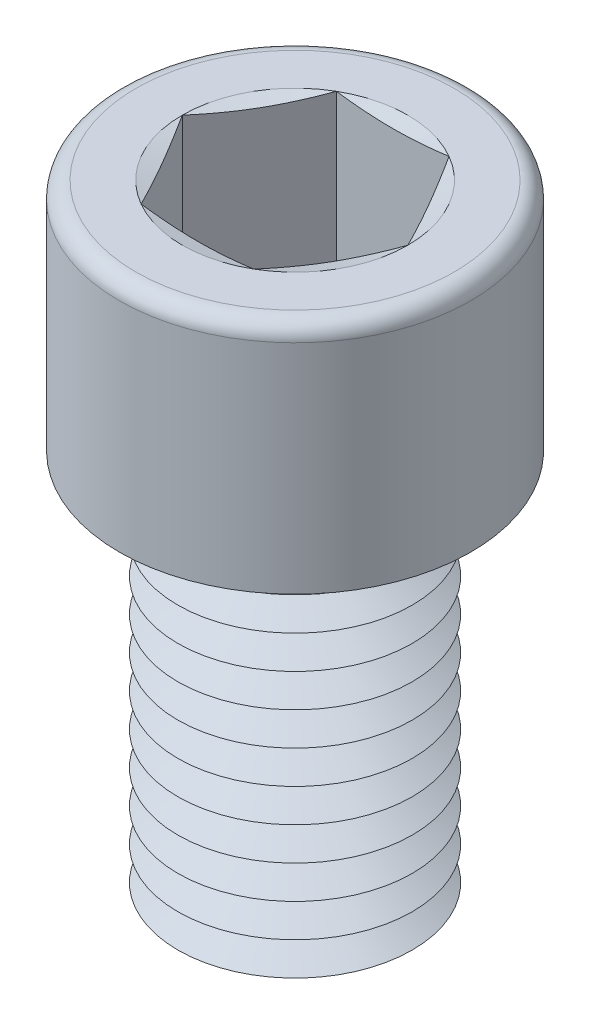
from build123d import *

# Parameters (mm, degrees)
SKETCH1_R       = 6
EXTRUDE1_DEPTH  = 20
SKETCH2_R       = 9
EXTRUDE2_DEPTH  = 12
EXTRUDE3_DEPTH  = 10
FILLET1_R       = 0.85
LPATTERN1_COUNT = 12
LPATTERN1_PITCH = 1.7


with BuildPart() as part:
    # Sketch1 → Extrude1 (new body)
    with BuildSketch(Plane(origin=(0, 0, 0), x_dir=(1, 0, 0), z_dir=(0, 1, 0))):
        with Locations(Location((0, 0, 0), (0, 0, 270))):
            Circle(SKETCH1_R)
    extrude(amount=EXTRUDE1_DEPTH)

    # Sketch2 → Extrude2 (add)
    with BuildSketch(Plane(origin=(0, 20, 0), x_dir=(1, 0, 0), z_dir=(0, 1, 0))):
        with Locations(Location((0, 0, 0), (0, 0, 270))):
            Circle(SKETCH2_R)
    extrude(amount=EXTRUDE2_DEPTH)

    # Sketch3 → Extrude3 (cut)
    with BuildSketch(Plane(origin=(0, 32, 0), x_dir=(1, 0, 0), z_dir=(0, 1, 0))):
        Polygon((2.886751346, 5), (-2.886751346, 5), (-5.773502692, 0), (-2.886751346, -5), (2.886751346, -5), (5.773502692, 0), align=None)
    extrude(amount=-EXTRUDE3_DEPTH, mode=Mode.SUBTRACT)

    # Fillet1
    fillet1_edges = [part.edges().sort_by_distance(p)[0] for p in [
        (0, 32, -9),
    ]]
    fillet(fillet1_edges, radius=FILLET1_R)

    # Sketch4 → Cut-Revolve1 (revolve, cut)
    with BuildSketch(Plane(origin=(0, 0, 0), x_dir=(0, 0, -1), z_dir=(1, 0, 0))):
        Polygon((-5, 22), (0, 22), (0, 19.113248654), align=None)
    revolve(axis=Axis((0, 22, 0), (0, -1, 0)), mode=Mode.SUBTRACT)

    # Sketch5 → Cut-Revolve2 (revolve, cut)
    with BuildSketch(Plane.XY, mode=Mode.PRIVATE) as cut_revolve2_sk:
        Polygon((-6, 0.85), (-6, -0.85), (-4.527756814, 0), align=None)
    cut_revolve2 = revolve(cut_revolve2_sk.sketch.rotate(Axis((0, 20, 0), (0, -1, 0)), 270), axis=Axis((0, 20, 0), (0, -1, 0)), mode=Mode.SUBTRACT)

    # LPattern1: Cut-Revolve2 ×12
    with Locations(*[(0, i * LPATTERN1_PITCH, 0) for i in range(1, LPATTERN1_COUNT)]):
        add(cut_revolve2, mode=Mode.SUBTRACT)

    # Extrude4 cone 1 section (on through the dimple's axis) → Extrude4 (revolve, cut)
    with BuildSketch(Plane(origin=(0, 32, 0), x_dir=(0, 0, 1), z_dir=(1, 0, 0))):
        Polygon((0, 0), (5.773502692, 0), (0, 1.547005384), align=None)
    revolve(axis=Axis((0, 32, 0), (0, -1, 0)), mode=Mode.SUBTRACT)


solid = part.part
